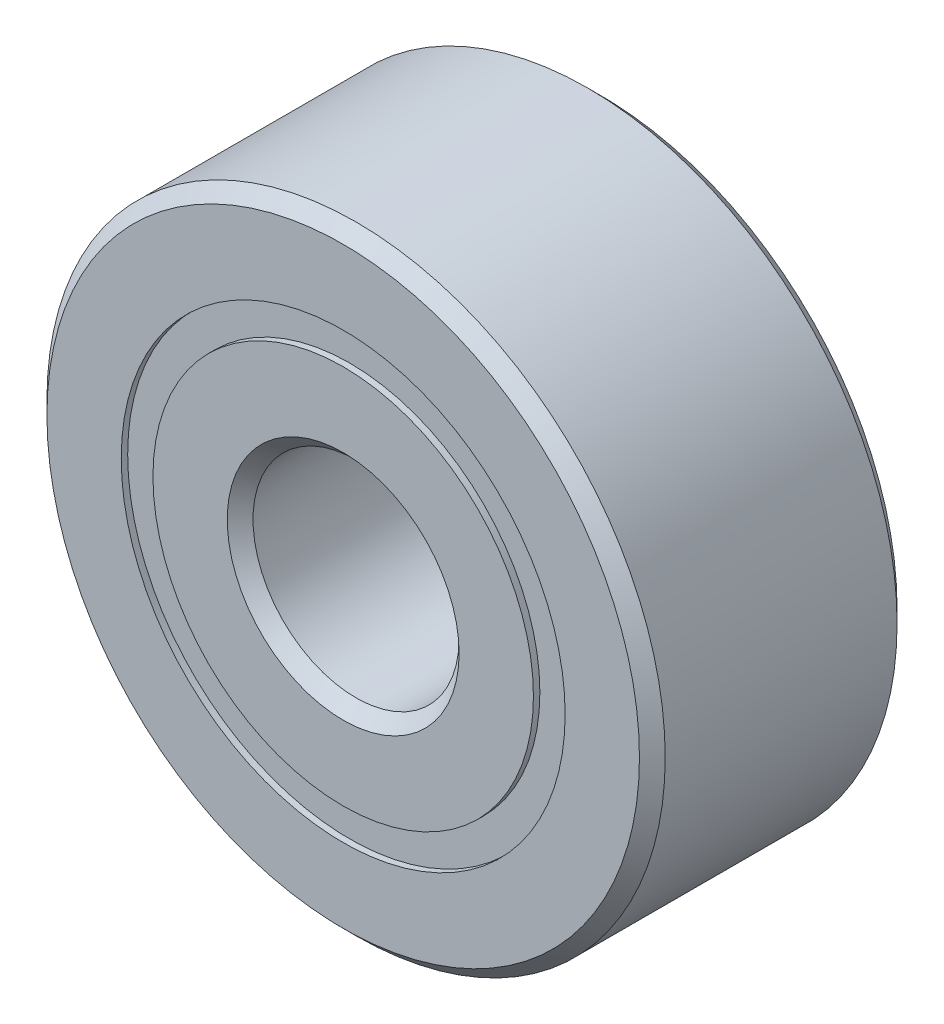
ISO-10303-21;
HEADER;
FILE_DESCRIPTION(('STEP AP214'),'2;1');
FILE_NAME('part.step','',(''),(''),'','','');
FILE_SCHEMA(('AUTOMOTIVE_DESIGN { 1 0 10303 214 1 1 1 1 }'));
ENDSEC;
DATA;
#1=APPLICATION_CONTEXT('core data for automotive mechanical design processes');
#2=APPLICATION_PROTOCOL_DEFINITION('international standard','automotive_design',2000,#1);
#3=PRODUCT_CONTEXT('',#1,'mechanical');
#4=PRODUCT('Part','Part','',(#3));
#5=PRODUCT_RELATED_PRODUCT_CATEGORY('part','',(#4));
#6=PRODUCT_DEFINITION_FORMATION('','',#4);
#7=PRODUCT_DEFINITION_CONTEXT('part definition',#1,'design');
#8=PRODUCT_DEFINITION('design','',#6,#7);
#9=PRODUCT_DEFINITION_SHAPE('','',#8);
#10=(LENGTH_UNIT() NAMED_UNIT(*) SI_UNIT(.MILLI.,.METRE.));
#11=(NAMED_UNIT(*) PLANE_ANGLE_UNIT() SI_UNIT($,.RADIAN.));
#12=(NAMED_UNIT(*) SI_UNIT($,.STERADIAN.) SOLID_ANGLE_UNIT());
#13=UNCERTAINTY_MEASURE_WITH_UNIT(LENGTH_MEASURE(1.E-05),#10,'distance_accuracy_value','');
#14=(GEOMETRIC_REPRESENTATION_CONTEXT(3) GLOBAL_UNCERTAINTY_ASSIGNED_CONTEXT((#13)) GLOBAL_UNIT_ASSIGNED_CONTEXT((#10,
#11,#12)) REPRESENTATION_CONTEXT('',''));
#15=CARTESIAN_POINT('',(0.,0.,0.));
#16=DIRECTION('',(0.,0.,1.));
#17=DIRECTION('',(1.,0.,0.));
#18=AXIS2_PLACEMENT_3D('',#15,#16,#17);
#19=CARTESIAN_POINT('',(-1.11022302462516E-12,3.41923076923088,-1.88515625));
#20=DIRECTION('',(0.,0.,1.));
#21=DIRECTION('',(1.00000000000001,0.,0.));
#22=AXIS2_PLACEMENT_3D('',#19,#20,#21);
#23=PLANE('',#22);
#24=CARTESIAN_POINT('',(0.,0.,-1.88515625));
#25=DIRECTION('',(0.,0.,1.));
#26=DIRECTION('',(1.00000000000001,0.,0.));
#27=AXIS2_PLACEMENT_3D('',#24,#25,#26);
#28=CIRCLE('',#27,3.41923076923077);
#29=CARTESIAN_POINT('',(3.41923076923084,0.,-1.88515625));
#30=VERTEX_POINT('',#29);
#31=EDGE_CURVE('E59',#30,#30,#28,.T.);
#32=ORIENTED_EDGE('',*,*,#31,.F.);
#33=EDGE_LOOP('',(#32));
#34=FACE_BOUND('',#33,.T.);
#35=CARTESIAN_POINT('',(0.,0.,-1.88515625));
#36=DIRECTION('',(0.,0.,1.));
#37=DIRECTION('',(1.00000000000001,0.,0.));
#38=AXIS2_PLACEMENT_3D('',#35,#36,#37);
#39=CIRCLE('',#38,2.93076923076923);
#40=CARTESIAN_POINT('',(2.9307692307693,0.,-1.88515625));
#41=VERTEX_POINT('',#40);
#42=EDGE_CURVE('E11',#41,#41,#39,.T.);
#43=ORIENTED_EDGE('',*,*,#42,.T.);
#44=EDGE_LOOP('',(#43));
#45=FACE_BOUND('',#44,.T.);
#46=ADVANCED_FACE('F45',(#34,#45),#23,.F.);
#47=CARTESIAN_POINT('',(0.,0.,1.984375));
#48=DIRECTION('',(0.,0.,1.));
#49=DIRECTION('',(1.00000000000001,0.,0.));
#50=AXIS2_PLACEMENT_3D('',#47,#48,#49);
#51=CYLINDRICAL_SURFACE('',#50,2.93076923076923);
#52=ORIENTED_EDGE('',*,*,#42,.F.);
#53=EDGE_LOOP('',(#52));
#54=FACE_BOUND('',#53,.T.);
#55=CARTESIAN_POINT('',(0.,0.,-0.915136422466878));
#56=DIRECTION('',(0.,0.,1.));
#57=DIRECTION('',(1.00000000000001,0.,0.));
#58=AXIS2_PLACEMENT_3D('',#55,#56,#57);
#59=CIRCLE('',#58,2.93076923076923);
#60=CARTESIAN_POINT('',(2.93076923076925,0.,-0.915136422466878));
#61=VERTEX_POINT('',#60);
#62=EDGE_CURVE('E51',#61,#61,#59,.T.);
#63=ORIENTED_EDGE('',*,*,#62,.T.);
#64=EDGE_LOOP('',(#63));
#65=FACE_BOUND('',#64,.T.);
#66=ADVANCED_FACE('F68',(#54,#65),#51,.F.);
#67=CARTESIAN_POINT('',(-1.11022302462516E-12,3.41923076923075,-0.915136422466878));
#68=DIRECTION('',(0.,0.,-1.));
#69=DIRECTION('',(-1.00000000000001,0.,0.));
#70=AXIS2_PLACEMENT_3D('',#67,#68,#69);
#71=PLANE('',#70);
#72=ORIENTED_EDGE('',*,*,#62,.F.);
#73=EDGE_LOOP('',(#72));
#74=FACE_BOUND('',#73,.T.);
#75=CARTESIAN_POINT('',(0.,0.,-0.915136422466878));
#76=DIRECTION('',(0.,0.,1.));
#77=DIRECTION('',(1.00000000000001,0.,0.));
#78=AXIS2_PLACEMENT_3D('',#75,#76,#77);
#79=CIRCLE('',#78,3.41923076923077);
#80=CARTESIAN_POINT('',(3.41923076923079,0.,-0.915136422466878));
#81=VERTEX_POINT('',#80);
#82=EDGE_CURVE('E55',#81,#81,#79,.T.);
#83=ORIENTED_EDGE('',*,*,#82,.T.);
#84=EDGE_LOOP('',(#83));
#85=FACE_BOUND('',#84,.T.);
#86=ADVANCED_FACE('F72',(#74,#85),#71,.F.);
#87=CARTESIAN_POINT('',(0.,0.,1.984375));
#88=DIRECTION('',(0.,0.,1.));
#89=DIRECTION('',(1.00000000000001,0.,0.));
#90=AXIS2_PLACEMENT_3D('',#87,#88,#89);
#91=CYLINDRICAL_SURFACE('',#90,3.41923076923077);
#92=ORIENTED_EDGE('',*,*,#82,.F.);
#93=EDGE_LOOP('',(#92));
#94=FACE_BOUND('',#93,.T.);
#95=ORIENTED_EDGE('',*,*,#31,.T.);
#96=EDGE_LOOP('',(#95));
#97=FACE_BOUND('',#96,.T.);
#98=ADVANCED_FACE('F65',(#94,#97),#91,.T.);
#99=CLOSED_SHELL('',(#46,#66,#86,#98));
#100=MANIFOLD_SOLID_BREP('B2',#99);
#101=CARTESIAN_POINT('',(-1.11022302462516E-12,3.41923076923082,1.88515625));
#102=DIRECTION('',(0.,0.,-1.));
#103=DIRECTION('',(-1.00000000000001,0.,0.));
#104=AXIS2_PLACEMENT_3D('',#101,#102,#103);
#105=PLANE('',#104);
#106=CARTESIAN_POINT('',(0.,0.,1.88515625));
#107=DIRECTION('',(0.,0.,1.));
#108=DIRECTION('',(1.00000000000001,0.,0.));
#109=AXIS2_PLACEMENT_3D('',#106,#107,#108);
#110=CIRCLE('',#109,2.93076923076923);
#111=CARTESIAN_POINT('',(2.93076923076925,0.,1.88515625));
#112=VERTEX_POINT('',#111);
#113=EDGE_CURVE('E44',#112,#112,#110,.T.);
#114=ORIENTED_EDGE('',*,*,#113,.F.);
#115=EDGE_LOOP('',(#114));
#116=FACE_BOUND('',#115,.T.);
#117=CARTESIAN_POINT('',(0.,0.,1.88515625));
#118=DIRECTION('',(0.,0.,1.));
#119=DIRECTION('',(1.00000000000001,0.,0.));
#120=AXIS2_PLACEMENT_3D('',#117,#118,#119);
#121=CIRCLE('',#120,3.41923076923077);
#122=CARTESIAN_POINT('',(3.41923076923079,0.,1.88515625));
#123=VERTEX_POINT('',#122);
#124=EDGE_CURVE('E118',#123,#123,#121,.T.);
#125=ORIENTED_EDGE('',*,*,#124,.T.);
#126=EDGE_LOOP('',(#125));
#127=FACE_BOUND('',#126,.T.);
#128=ADVANCED_FACE('F104',(#116,#127),#105,.F.);
#129=CARTESIAN_POINT('',(0.,0.,1.984375));
#130=DIRECTION('',(0.,0.,1.));
#131=DIRECTION('',(1.00000000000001,0.,0.));
#132=AXIS2_PLACEMENT_3D('',#129,#130,#131);
#133=CYLINDRICAL_SURFACE('',#132,2.93076923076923);
#134=CARTESIAN_POINT('',(0.,0.,0.915136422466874));
#135=DIRECTION('',(0.,0.,1.));
#136=DIRECTION('',(1.00000000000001,0.,0.));
#137=AXIS2_PLACEMENT_3D('',#134,#135,#136);
#138=CIRCLE('',#137,2.93076923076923);
#139=CARTESIAN_POINT('',(2.93076923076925,0.,0.915136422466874));
#140=VERTEX_POINT('',#139);
#141=EDGE_CURVE('E110',#140,#140,#138,.T.);
#142=ORIENTED_EDGE('',*,*,#141,.F.);
#143=EDGE_LOOP('',(#142));
#144=FACE_BOUND('',#143,.T.);
#145=ORIENTED_EDGE('',*,*,#113,.T.);
#146=EDGE_LOOP('',(#145));
#147=FACE_BOUND('',#146,.T.);
#148=ADVANCED_FACE('F133',(#144,#147),#133,.F.);
#149=CARTESIAN_POINT('',(-1.11022302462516E-12,3.41923076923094,0.915136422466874));
#150=DIRECTION('',(0.,0.,1.));
#151=DIRECTION('',(1.00000000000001,0.,0.));
#152=AXIS2_PLACEMENT_3D('',#149,#150,#151);
#153=PLANE('',#152);
#154=CARTESIAN_POINT('',(0.,0.,0.915136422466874));
#155=DIRECTION('',(0.,0.,1.));
#156=DIRECTION('',(1.00000000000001,0.,0.));
#157=AXIS2_PLACEMENT_3D('',#154,#155,#156);
#158=CIRCLE('',#157,3.41923076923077);
#159=CARTESIAN_POINT('',(3.41923076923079,0.,0.915136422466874));
#160=VERTEX_POINT('',#159);
#161=EDGE_CURVE('E114',#160,#160,#158,.T.);
#162=ORIENTED_EDGE('',*,*,#161,.F.);
#163=EDGE_LOOP('',(#162));
#164=FACE_BOUND('',#163,.T.);
#165=ORIENTED_EDGE('',*,*,#141,.T.);
#166=EDGE_LOOP('',(#165));
#167=FACE_BOUND('',#166,.T.);
#168=ADVANCED_FACE('F128',(#164,#167),#153,.F.);
#169=CARTESIAN_POINT('',(0.,0.,1.984375));
#170=DIRECTION('',(0.,0.,1.));
#171=DIRECTION('',(1.00000000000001,0.,0.));
#172=AXIS2_PLACEMENT_3D('',#169,#170,#171);
#173=CYLINDRICAL_SURFACE('',#172,3.41923076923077);
#174=ORIENTED_EDGE('',*,*,#124,.F.);
#175=EDGE_LOOP('',(#174));
#176=FACE_BOUND('',#175,.T.);
#177=ORIENTED_EDGE('',*,*,#161,.T.);
#178=EDGE_LOOP('',(#177));
#179=FACE_BOUND('',#178,.T.);
#180=ADVANCED_FACE('F125',(#176,#179),#173,.T.);
#181=CLOSED_SHELL('',(#128,#148,#168,#180));
#182=MANIFOLD_SOLID_BREP('B6',#181);
#183=CARTESIAN_POINT('',(-1.86621817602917,2.56862895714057,0.));
#184=DIRECTION('',(0.,0.,1.));
#185=DIRECTION('',(-0.587785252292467,0.80901699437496,0.));
#186=AXIS2_PLACEMENT_3D('',#183,#184,#185);
#187=SPHERICAL_SURFACE('',#186,0.915136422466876);
#188=CARTESIAN_POINT('',(-1.86621817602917,2.56862895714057,0.915136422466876));
#189=VERTEX_POINT('',#188);
#190=VERTEX_LOOP('',#189);
#191=FACE_BOUND('',#190,.T.);
#192=ADVANCED_FACE('F163',(#191),#187,.T.);
#193=CLOSED_SHELL('',(#192));
#194=MANIFOLD_SOLID_BREP('B39',#193);
#195=CARTESIAN_POINT('',(-3.01960443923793,0.981128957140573,0.));
#196=DIRECTION('',(0.,0.,1.));
#197=DIRECTION('',(-0.951056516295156,0.30901699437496,0.));
#198=AXIS2_PLACEMENT_3D('',#195,#196,#197);
#199=SPHERICAL_SURFACE('',#198,0.915136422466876);
#200=CARTESIAN_POINT('',(-3.01960443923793,0.981128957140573,0.915136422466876));
#201=VERTEX_POINT('',#200);
#202=VERTEX_LOOP('',#201);
#203=FACE_BOUND('',#202,.T.);
#204=ADVANCED_FACE('F181',(#203),#199,.T.);
#205=CLOSED_SHELL('',(#204));
#206=MANIFOLD_SOLID_BREP('B100',#205);
#207=CARTESIAN_POINT('',(-3.01960443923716,-0.981128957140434,0.));
#208=DIRECTION('',(0.,0.,1.));
#209=DIRECTION('',(-0.951056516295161,-0.30901699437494,0.));
#210=AXIS2_PLACEMENT_3D('',#207,#208,#209);
#211=SPHERICAL_SURFACE('',#210,0.915136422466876);
#212=CARTESIAN_POINT('',(-3.01960443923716,-0.981128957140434,0.915136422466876));
#213=VERTEX_POINT('',#212);
#214=VERTEX_LOOP('',#213);
#215=FACE_BOUND('',#214,.T.);
#216=ADVANCED_FACE('F199',(#215),#211,.T.);
#217=CLOSED_SHELL('',(#216));
#218=MANIFOLD_SOLID_BREP('B159',#217);
#219=CARTESIAN_POINT('',(-1.86621817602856,-2.56862895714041,0.));
#220=DIRECTION('',(0.,0.,1.));
#221=DIRECTION('',(-0.587785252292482,-0.809016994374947,0.));
#222=AXIS2_PLACEMENT_3D('',#219,#220,#221);
#223=SPHERICAL_SURFACE('',#222,0.915136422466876);
#224=CARTESIAN_POINT('',(-1.86621817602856,-2.56862895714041,0.915136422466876));
#225=VERTEX_POINT('',#224);
#226=VERTEX_LOOP('',#225);
#227=FACE_BOUND('',#226,.T.);
#228=ADVANCED_FACE('F217',(#227),#223,.T.);
#229=CLOSED_SHELL('',(#228));
#230=MANIFOLD_SOLID_BREP('B177',#229);
#231=CARTESIAN_POINT('',(0.,-3.17500000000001,0.));
#232=DIRECTION('',(0.,0.,1.));
#233=DIRECTION('',(0.,-1.00000000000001,0.));
#234=AXIS2_PLACEMENT_3D('',#231,#232,#233);
#235=SPHERICAL_SURFACE('',#234,0.915136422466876);
#236=CARTESIAN_POINT('',(0.,-3.17500000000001,0.915136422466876));
#237=VERTEX_POINT('',#236);
#238=VERTEX_LOOP('',#237);
#239=FACE_BOUND('',#238,.T.);
#240=ADVANCED_FACE('F235',(#239),#235,.T.);
#241=CLOSED_SHELL('',(#240));
#242=MANIFOLD_SOLID_BREP('B195',#241);
#243=CARTESIAN_POINT('',(1.86621817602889,-2.56862895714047,0.));
#244=DIRECTION('',(0.,0.,1.));
#245=DIRECTION('',(0.58778525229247,-0.809016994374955,0.));
#246=AXIS2_PLACEMENT_3D('',#243,#244,#245);
#247=SPHERICAL_SURFACE('',#246,0.915136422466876);
#248=CARTESIAN_POINT('',(1.86621817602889,-2.56862895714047,0.915136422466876));
#249=VERTEX_POINT('',#248);
#250=VERTEX_LOOP('',#249);
#251=FACE_BOUND('',#250,.T.);
#252=ADVANCED_FACE('F253',(#251),#247,.T.);
#253=CLOSED_SHELL('',(#252));
#254=MANIFOLD_SOLID_BREP('B213',#253);
#255=CARTESIAN_POINT('',(3.01960443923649,-0.981128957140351,0.));
#256=DIRECTION('',(0.,0.,1.));
#257=DIRECTION('',(0.951056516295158,-0.309016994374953,0.));
#258=AXIS2_PLACEMENT_3D('',#255,#256,#257);
#259=SPHERICAL_SURFACE('',#258,0.915136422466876);
#260=CARTESIAN_POINT('',(3.01960443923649,-0.981128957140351,0.915136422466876));
#261=VERTEX_POINT('',#260);
#262=VERTEX_LOOP('',#261);
#263=FACE_BOUND('',#262,.T.);
#264=ADVANCED_FACE('F271',(#263),#259,.T.);
#265=CLOSED_SHELL('',(#264));
#266=MANIFOLD_SOLID_BREP('B231',#265);
#267=CARTESIAN_POINT('',(3.01960443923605,0.981128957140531,0.));
#268=DIRECTION('',(0.,0.,1.));
#269=DIRECTION('',(0.95105651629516,0.309016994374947,0.));
#270=AXIS2_PLACEMENT_3D('',#267,#268,#269);
#271=SPHERICAL_SURFACE('',#270,0.915136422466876);
#272=CARTESIAN_POINT('',(3.01960443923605,0.981128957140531,0.915136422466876));
#273=VERTEX_POINT('',#272);
#274=VERTEX_LOOP('',#273);
#275=FACE_BOUND('',#274,.T.);
#276=ADVANCED_FACE('F289',(#275),#271,.T.);
#277=CLOSED_SHELL('',(#276));
#278=MANIFOLD_SOLID_BREP('B249',#277);
#279=CARTESIAN_POINT('',(1.86621817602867,2.56862895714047,0.));
#280=DIRECTION('',(0.,0.,1.));
#281=DIRECTION('',(0.587785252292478,0.80901699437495,0.));
#282=AXIS2_PLACEMENT_3D('',#279,#280,#281);
#283=SPHERICAL_SURFACE('',#282,0.915136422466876);
#284=CARTESIAN_POINT('',(1.86621817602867,2.56862895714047,0.915136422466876));
#285=VERTEX_POINT('',#284);
#286=VERTEX_LOOP('',#285);
#287=FACE_BOUND('',#286,.T.);
#288=ADVANCED_FACE('F307',(#287),#283,.T.);
#289=CLOSED_SHELL('',(#288));
#290=MANIFOLD_SOLID_BREP('B267',#289);
#291=CARTESIAN_POINT('',(-9.43689570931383E-13,3.17500000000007,0.));
#292=DIRECTION('',(0.,0.,1.));
#293=DIRECTION('',(0.,1.00000000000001,0.));
#294=AXIS2_PLACEMENT_3D('',#291,#292,#293);
#295=SPHERICAL_SURFACE('',#294,0.915136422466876);
#296=CARTESIAN_POINT('',(-9.43689570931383E-13,3.17500000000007,0.915136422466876));
#297=VERTEX_POINT('',#296);
#298=VERTEX_LOOP('',#297);
#299=FACE_BOUND('',#298,.T.);
#300=ADVANCED_FACE('F327',(#299),#295,.T.);
#301=CLOSED_SHELL('',(#300));
#302=MANIFOLD_SOLID_BREP('B285',#301);
#303=CARTESIAN_POINT('',(-3.33066907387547E-13,2.9307692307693,1.984375));
#304=DIRECTION('',(0.,0.,-1.));
#305=DIRECTION('',(-1.00000000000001,0.,0.));
#306=AXIS2_PLACEMENT_3D('',#303,#304,#305);
#307=PLANE('',#306);
#308=CARTESIAN_POINT('',(0.,0.,1.984375));
#309=DIRECTION('',(0.,0.,1.));
#310=DIRECTION('',(1.00000000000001,0.,0.));
#311=AXIS2_PLACEMENT_3D('',#308,#309,#310);
#312=CIRCLE('',#311,1.7859375);
#313=CARTESIAN_POINT('',(1.78593750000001,0.,1.984375));
#314=VERTEX_POINT('',#313);
#315=EDGE_CURVE('E372',#314,#314,#312,.T.);
#316=ORIENTED_EDGE('',*,*,#315,.F.);
#317=EDGE_LOOP('',(#316));
#318=FACE_BOUND('',#317,.T.);
#319=CARTESIAN_POINT('',(0.,0.,1.984375));
#320=DIRECTION('',(0.,0.,1.));
#321=DIRECTION('',(1.00000000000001,0.,0.));
#322=AXIS2_PLACEMENT_3D('',#319,#320,#321);
#323=CIRCLE('',#322,2.93076923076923);
#324=CARTESIAN_POINT('',(2.93076923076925,0.,1.984375));
#325=VERTEX_POINT('',#324);
#326=EDGE_CURVE('E326',#325,#325,#323,.T.);
#327=ORIENTED_EDGE('',*,*,#326,.T.);
#328=EDGE_LOOP('',(#327));
#329=FACE_BOUND('',#328,.T.);
#330=ADVANCED_FACE('F344',(#318,#329),#307,.F.);
#331=CARTESIAN_POINT('',(0.,0.,1.984375));
#332=DIRECTION('',(0.,0.,1.));
#333=DIRECTION('',(1.00000000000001,0.,0.));
#334=AXIS2_PLACEMENT_3D('',#331,#332,#333);
#335=CYLINDRICAL_SURFACE('',#334,2.93076923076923);
#336=ORIENTED_EDGE('',*,*,#326,.F.);
#337=EDGE_LOOP('',(#336));
#338=FACE_BOUND('',#337,.T.);
#339=CARTESIAN_POINT('',(0.,0.,0.881944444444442));
#340=DIRECTION('',(0.,0.,1.));
#341=DIRECTION('',(1.00000000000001,0.,0.));
#342=AXIS2_PLACEMENT_3D('',#339,#340,#341);
#343=CIRCLE('',#342,2.93076923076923);
#344=CARTESIAN_POINT('',(2.93076923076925,0.,0.881944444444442));
#345=VERTEX_POINT('',#344);
#346=EDGE_CURVE('E350',#345,#345,#343,.T.);
#347=ORIENTED_EDGE('',*,*,#346,.T.);
#348=EDGE_LOOP('',(#347));
#349=FACE_BOUND('',#348,.T.);
#350=ADVANCED_FACE('F379',(#338,#349),#335,.T.);
#351=CARTESIAN_POINT('',(0.,0.,0.));
#352=DIRECTION('',(0.,0.,1.));
#353=DIRECTION('',(1.00000000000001,0.,0.));
#354=AXIS2_PLACEMENT_3D('',#351,#352,#353);
#355=TOROIDAL_SURFACE('',#354,3.175,0.915136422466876);
#356=ORIENTED_EDGE('',*,*,#346,.F.);
#357=EDGE_LOOP('',(#356));
#358=FACE_BOUND('',#357,.T.);
#359=CARTESIAN_POINT('',(0.,0.,-0.881944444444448));
#360=DIRECTION('',(0.,0.,1.));
#361=DIRECTION('',(1.00000000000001,0.,0.));
#362=AXIS2_PLACEMENT_3D('',#359,#360,#361);
#363=CIRCLE('',#362,2.93076923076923);
#364=CARTESIAN_POINT('',(2.93076923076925,0.,-0.881944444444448));
#365=VERTEX_POINT('',#364);
#366=EDGE_CURVE('E354',#365,#365,#363,.T.);
#367=ORIENTED_EDGE('',*,*,#366,.T.);
#368=EDGE_LOOP('',(#367));
#369=FACE_BOUND('',#368,.T.);
#370=ADVANCED_FACE('F383',(#358,#369),#355,.F.);
#371=CARTESIAN_POINT('',(0.,0.,1.984375));
#372=DIRECTION('',(0.,0.,1.));
#373=DIRECTION('',(1.00000000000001,0.,0.));
#374=AXIS2_PLACEMENT_3D('',#371,#372,#373);
#375=CYLINDRICAL_SURFACE('',#374,2.93076923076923);
#376=ORIENTED_EDGE('',*,*,#366,.F.);
#377=EDGE_LOOP('',(#376));
#378=FACE_BOUND('',#377,.T.);
#379=CARTESIAN_POINT('',(0.,0.,-1.984375));
#380=DIRECTION('',(0.,0.,1.));
#381=DIRECTION('',(1.00000000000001,0.,0.));
#382=AXIS2_PLACEMENT_3D('',#379,#380,#381);
#383=CIRCLE('',#382,2.93076923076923);
#384=CARTESIAN_POINT('',(2.9307692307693,0.,-1.984375));
#385=VERTEX_POINT('',#384);
#386=EDGE_CURVE('E358',#385,#385,#383,.T.);
#387=ORIENTED_EDGE('',*,*,#386,.T.);
#388=EDGE_LOOP('',(#387));
#389=FACE_BOUND('',#388,.T.);
#390=ADVANCED_FACE('F388',(#378,#389),#375,.T.);
#391=CARTESIAN_POINT('',(0.,1.78593750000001,-1.984375));
#392=DIRECTION('',(0.,0.,1.));
#393=DIRECTION('',(1.00000000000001,0.,0.));
#394=AXIS2_PLACEMENT_3D('',#391,#392,#393);
#395=PLANE('',#394);
#396=ORIENTED_EDGE('',*,*,#386,.F.);
#397=EDGE_LOOP('',(#396));
#398=FACE_BOUND('',#397,.T.);
#399=CARTESIAN_POINT('',(0.,0.,-1.984375));
#400=DIRECTION('',(0.,0.,1.));
#401=DIRECTION('',(1.00000000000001,0.,0.));
#402=AXIS2_PLACEMENT_3D('',#399,#400,#401);
#403=CIRCLE('',#402,1.7859375);
#404=CARTESIAN_POINT('',(1.78593750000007,0.,-1.984375));
#405=VERTEX_POINT('',#404);
#406=EDGE_CURVE('E363',#405,#405,#403,.T.);
#407=ORIENTED_EDGE('',*,*,#406,.T.);
#408=EDGE_LOOP('',(#407));
#409=FACE_BOUND('',#408,.T.);
#410=ADVANCED_FACE('F394',(#398,#409),#395,.F.);
#411=CARTESIAN_POINT('',(0.,0.,-1.7859375));
#412=DIRECTION('',(0.,0.,-1.));
#413=DIRECTION('',(-1.00000000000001,0.,0.));
#414=AXIS2_PLACEMENT_3D('',#411,#412,#413);
#415=CONICAL_SURFACE('',#414,1.5875,0.785398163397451);
#416=ORIENTED_EDGE('',*,*,#406,.F.);
#417=EDGE_LOOP('',(#416));
#418=FACE_BOUND('',#417,.T.);
#419=CARTESIAN_POINT('',(0.,0.,-1.7859375));
#420=DIRECTION('',(0.,0.,1.));
#421=DIRECTION('',(1.00000000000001,0.,0.));
#422=AXIS2_PLACEMENT_3D('',#419,#420,#421);
#423=CIRCLE('',#422,1.5875);
#424=CARTESIAN_POINT('',(1.58750000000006,0.,-1.7859375));
#425=VERTEX_POINT('',#424);
#426=EDGE_CURVE('E366',#425,#425,#423,.T.);
#427=ORIENTED_EDGE('',*,*,#426,.T.);
#428=EDGE_LOOP('',(#427));
#429=FACE_BOUND('',#428,.T.);
#430=ADVANCED_FACE('F398',(#418,#429),#415,.F.);
#431=CARTESIAN_POINT('',(0.,0.,1.984375));
#432=DIRECTION('',(0.,0.,1.));
#433=DIRECTION('',(1.00000000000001,0.,0.));
#434=AXIS2_PLACEMENT_3D('',#431,#432,#433);
#435=CYLINDRICAL_SURFACE('',#434,1.5875);
#436=ORIENTED_EDGE('',*,*,#426,.F.);
#437=EDGE_LOOP('',(#436));
#438=FACE_BOUND('',#437,.T.);
#439=CARTESIAN_POINT('',(0.,0.,1.7859375));
#440=DIRECTION('',(0.,0.,1.));
#441=DIRECTION('',(1.00000000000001,0.,0.));
#442=AXIS2_PLACEMENT_3D('',#439,#440,#441);
#443=CIRCLE('',#442,1.5875);
#444=CARTESIAN_POINT('',(1.58750000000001,0.,1.7859375));
#445=VERTEX_POINT('',#444);
#446=EDGE_CURVE('E369',#445,#445,#443,.T.);
#447=ORIENTED_EDGE('',*,*,#446,.T.);
#448=EDGE_LOOP('',(#447));
#449=FACE_BOUND('',#448,.T.);
#450=ADVANCED_FACE('F402',(#438,#449),#435,.F.);
#451=CARTESIAN_POINT('',(0.,0.,1.984375));
#452=DIRECTION('',(0.,0.,1.));
#453=DIRECTION('',(1.00000000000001,0.,0.));
#454=AXIS2_PLACEMENT_3D('',#451,#452,#453);
#455=CONICAL_SURFACE('',#454,1.7859375,0.785398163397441);
#456=ORIENTED_EDGE('',*,*,#446,.F.);
#457=EDGE_LOOP('',(#456));
#458=FACE_BOUND('',#457,.T.);
#459=ORIENTED_EDGE('',*,*,#315,.T.);
#460=EDGE_LOOP('',(#459));
#461=FACE_BOUND('',#460,.T.);
#462=ADVANCED_FACE('F376',(#458,#461),#455,.F.);
#463=CLOSED_SHELL('',(#330,#350,#370,#390,#410,#430,#450,#462));
#464=MANIFOLD_SOLID_BREP('B303',#463);
#465=CARTESIAN_POINT('',(0.,0.,1.7859375));
#466=DIRECTION('',(0.,0.,-1.));
#467=DIRECTION('',(-1.00000000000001,0.,0.));
#468=AXIS2_PLACEMENT_3D('',#465,#466,#467);
#469=CONICAL_SURFACE('',#468,4.7625,0.785398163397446);
#470=CARTESIAN_POINT('',(0.,0.,1.984375));
#471=DIRECTION('',(0.,0.,1.));
#472=DIRECTION('',(1.00000000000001,0.,0.));
#473=AXIS2_PLACEMENT_3D('',#470,#471,#472);
#474=CIRCLE('',#473,4.5640625);
#475=CARTESIAN_POINT('',(4.56406250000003,0.,1.984375));
#476=VERTEX_POINT('',#475);
#477=EDGE_CURVE('E477',#476,#476,#474,.T.);
#478=ORIENTED_EDGE('',*,*,#477,.F.);
#479=EDGE_LOOP('',(#478));
#480=FACE_BOUND('',#479,.T.);
#481=CARTESIAN_POINT('',(0.,0.,1.7859375));
#482=DIRECTION('',(0.,0.,1.));
#483=DIRECTION('',(1.00000000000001,0.,0.));
#484=AXIS2_PLACEMENT_3D('',#481,#482,#483);
#485=CIRCLE('',#484,4.7625);
#486=CARTESIAN_POINT('',(4.76250000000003,0.,1.7859375));
#487=VERTEX_POINT('',#486);
#488=EDGE_CURVE('E343',#487,#487,#485,.T.);
#489=ORIENTED_EDGE('',*,*,#488,.T.);
#490=EDGE_LOOP('',(#489));
#491=FACE_BOUND('',#490,.T.);
#492=ADVANCED_FACE('F449',(#480,#491),#469,.T.);
#493=CARTESIAN_POINT('',(0.,0.,1.984375));
#494=DIRECTION('',(0.,0.,1.));
#495=DIRECTION('',(1.00000000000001,0.,0.));
#496=AXIS2_PLACEMENT_3D('',#493,#494,#495);
#497=CYLINDRICAL_SURFACE('',#496,4.7625);
#498=ORIENTED_EDGE('',*,*,#488,.F.);
#499=EDGE_LOOP('',(#498));
#500=FACE_BOUND('',#499,.T.);
#501=CARTESIAN_POINT('',(0.,0.,-1.7859375));
#502=DIRECTION('',(0.,0.,1.));
#503=DIRECTION('',(1.00000000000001,0.,0.));
#504=AXIS2_PLACEMENT_3D('',#501,#502,#503);
#505=CIRCLE('',#504,4.7625);
#506=CARTESIAN_POINT('',(4.76250000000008,0.,-1.7859375));
#507=VERTEX_POINT('',#506);
#508=EDGE_CURVE('E455',#507,#507,#505,.T.);
#509=ORIENTED_EDGE('',*,*,#508,.T.);
#510=EDGE_LOOP('',(#509));
#511=FACE_BOUND('',#510,.T.);
#512=ADVANCED_FACE('F484',(#500,#511),#497,.T.);
#513=CARTESIAN_POINT('',(0.,0.,-1.984375));
#514=DIRECTION('',(0.,0.,1.));
#515=DIRECTION('',(1.00000000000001,0.,0.));
#516=AXIS2_PLACEMENT_3D('',#513,#514,#515);
#517=CONICAL_SURFACE('',#516,4.5640625,0.785398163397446);
#518=ORIENTED_EDGE('',*,*,#508,.F.);
#519=EDGE_LOOP('',(#518));
#520=FACE_BOUND('',#519,.T.);
#521=CARTESIAN_POINT('',(0.,0.,-1.984375));
#522=DIRECTION('',(0.,0.,1.));
#523=DIRECTION('',(1.00000000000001,0.,0.));
#524=AXIS2_PLACEMENT_3D('',#521,#522,#523);
#525=CIRCLE('',#524,4.5640625);
#526=CARTESIAN_POINT('',(4.56406250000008,0.,-1.984375));
#527=VERTEX_POINT('',#526);
#528=EDGE_CURVE('E459',#527,#527,#525,.T.);
#529=ORIENTED_EDGE('',*,*,#528,.T.);
#530=EDGE_LOOP('',(#529));
#531=FACE_BOUND('',#530,.T.);
#532=ADVANCED_FACE('F488',(#520,#531),#517,.T.);
#533=CARTESIAN_POINT('',(0.,4.56406250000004,-1.984375));
#534=DIRECTION('',(0.,0.,1.));
#535=DIRECTION('',(1.00000000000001,0.,0.));
#536=AXIS2_PLACEMENT_3D('',#533,#534,#535);
#537=PLANE('',#536);
#538=ORIENTED_EDGE('',*,*,#528,.F.);
#539=EDGE_LOOP('',(#538));
#540=FACE_BOUND('',#539,.T.);
#541=CARTESIAN_POINT('',(0.,0.,-1.984375));
#542=DIRECTION('',(0.,0.,1.));
#543=DIRECTION('',(1.00000000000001,0.,0.));
#544=AXIS2_PLACEMENT_3D('',#541,#542,#543);
#545=CIRCLE('',#544,3.41923076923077);
#546=CARTESIAN_POINT('',(3.41923076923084,0.,-1.984375));
#547=VERTEX_POINT('',#546);
#548=EDGE_CURVE('E463',#547,#547,#545,.T.);
#549=ORIENTED_EDGE('',*,*,#548,.T.);
#550=EDGE_LOOP('',(#549));
#551=FACE_BOUND('',#550,.T.);
#552=ADVANCED_FACE('F493',(#540,#551),#537,.F.);
#553=CARTESIAN_POINT('',(0.,0.,1.984375));
#554=DIRECTION('',(0.,0.,1.));
#555=DIRECTION('',(1.00000000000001,0.,0.));
#556=AXIS2_PLACEMENT_3D('',#553,#554,#555);
#557=CYLINDRICAL_SURFACE('',#556,3.41923076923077);
#558=ORIENTED_EDGE('',*,*,#548,.F.);
#559=EDGE_LOOP('',(#558));
#560=FACE_BOUND('',#559,.T.);
#561=CARTESIAN_POINT('',(0.,0.,-0.881944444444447));
#562=DIRECTION('',(0.,0.,1.));
#563=DIRECTION('',(1.00000000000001,0.,0.));
#564=AXIS2_PLACEMENT_3D('',#561,#562,#563);
#565=CIRCLE('',#564,3.41923076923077);
#566=CARTESIAN_POINT('',(3.41923076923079,0.,-0.881944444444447));
#567=VERTEX_POINT('',#566);
#568=EDGE_CURVE('E468',#567,#567,#565,.T.);
#569=ORIENTED_EDGE('',*,*,#568,.T.);
#570=EDGE_LOOP('',(#569));
#571=FACE_BOUND('',#570,.T.);
#572=ADVANCED_FACE('F499',(#560,#571),#557,.F.);
#573=CARTESIAN_POINT('',(0.,0.,0.));
#574=DIRECTION('',(0.,0.,1.));
#575=DIRECTION('',(1.00000000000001,0.,0.));
#576=AXIS2_PLACEMENT_3D('',#573,#574,#575);
#577=TOROIDAL_SURFACE('',#576,3.175,0.915136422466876);
#578=ORIENTED_EDGE('',*,*,#568,.F.);
#579=EDGE_LOOP('',(#578));
#580=FACE_BOUND('',#579,.T.);
#581=CARTESIAN_POINT('',(0.,0.,0.881944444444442));
#582=DIRECTION('',(0.,0.,1.));
#583=DIRECTION('',(1.00000000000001,0.,0.));
#584=AXIS2_PLACEMENT_3D('',#581,#582,#583);
#585=CIRCLE('',#584,3.41923076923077);
#586=CARTESIAN_POINT('',(3.41923076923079,0.,0.881944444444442));
#587=VERTEX_POINT('',#586);
#588=EDGE_CURVE('E471',#587,#587,#585,.T.);
#589=ORIENTED_EDGE('',*,*,#588,.T.);
#590=EDGE_LOOP('',(#589));
#591=FACE_BOUND('',#590,.T.);
#592=ADVANCED_FACE('F503',(#580,#591),#577,.F.);
#593=CARTESIAN_POINT('',(0.,0.,1.984375));
#594=DIRECTION('',(0.,0.,1.));
#595=DIRECTION('',(1.00000000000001,0.,0.));
#596=AXIS2_PLACEMENT_3D('',#593,#594,#595);
#597=CYLINDRICAL_SURFACE('',#596,3.41923076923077);
#598=ORIENTED_EDGE('',*,*,#588,.F.);
#599=EDGE_LOOP('',(#598));
#600=FACE_BOUND('',#599,.T.);
#601=CARTESIAN_POINT('',(0.,0.,1.984375));
#602=DIRECTION('',(0.,0.,1.));
#603=DIRECTION('',(1.00000000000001,0.,0.));
#604=AXIS2_PLACEMENT_3D('',#601,#602,#603);
#605=CIRCLE('',#604,3.41923076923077);
#606=CARTESIAN_POINT('',(3.41923076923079,0.,1.984375));
#607=VERTEX_POINT('',#606);
#608=EDGE_CURVE('E474',#607,#607,#605,.T.);
#609=ORIENTED_EDGE('',*,*,#608,.T.);
#610=EDGE_LOOP('',(#609));
#611=FACE_BOUND('',#610,.T.);
#612=ADVANCED_FACE('F507',(#600,#611),#597,.F.);
#613=CARTESIAN_POINT('',(0.,4.5640625,1.984375));
#614=DIRECTION('',(0.,0.,-1.));
#615=DIRECTION('',(-1.00000000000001,0.,0.));
#616=AXIS2_PLACEMENT_3D('',#613,#614,#615);
#617=PLANE('',#616);
#618=ORIENTED_EDGE('',*,*,#608,.F.);
#619=EDGE_LOOP('',(#618));
#620=FACE_BOUND('',#619,.T.);
#621=ORIENTED_EDGE('',*,*,#477,.T.);
#622=EDGE_LOOP('',(#621));
#623=FACE_BOUND('',#622,.T.);
#624=ADVANCED_FACE('F481',(#620,#623),#617,.F.);
#625=CLOSED_SHELL('',(#492,#512,#532,#552,#572,#592,#612,#624));
#626=MANIFOLD_SOLID_BREP('B321',#625);
#627=ADVANCED_BREP_SHAPE_REPRESENTATION('',(#18,#100,#182,#194,#206,#218,#230,#242,#254,#266,
#278,#290,#302,#464,#626),#14);
#628=SHAPE_DEFINITION_REPRESENTATION(#9,#627);
ENDSEC;
END-ISO-10303-21;
